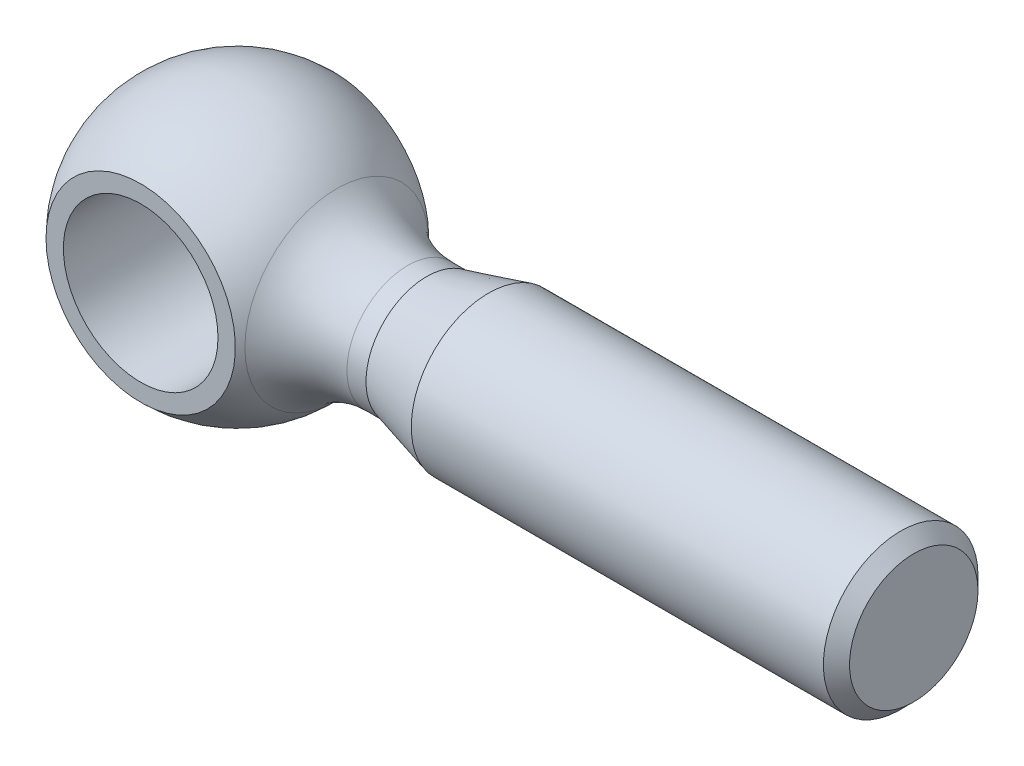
from build123d import *

# Parameters (mm, degrees)
SKETCH2_R               = 4
BASEBODY_DEPTH          = 35
CUT_EXTRUDE1_DEPTH      = 37.373066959
CUT_EXTRUDE1_DEPTH_BACK = 37.373066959
SKETCH4_R               = 4
HOLE_DEPTH              = 38.067505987
CHAMFER1_SIZE           = 0.6765
HEADFILLET_R            = 5


with BuildPart() as part:
    # Sketch2 → BaseBody (new body)
    with BuildSketch(Plane(origin=(0, 0, 0), x_dir=(0, 0, -1), z_dir=(1, 0, 0))):
        Circle(SKETCH2_R)
    extrude(amount=BASEBODY_DEPTH)

    # Sketch5 → Cut-Revolve1 (revolve, cut)
    with BuildSketch(Plane.XY, mode=Mode.PRIVATE) as cut_revolve1_sk:
        Polygon((0, 3.142562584), (9.8, 3.142562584), (13, 4), (0, 4), align=None)
    revolve(cut_revolve1_sk.sketch.rotate(Axis((35, 0, 0), (-1, 0, 0)), 90), axis=Axis((35, 0, 0), (-1, 0, 0)), mode=Mode.SUBTRACT)

    # Sketch1 → BaseHead (revolve)
    with BuildSketch(Plane(origin=(0.956717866, 0, -6.043282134), x_dir=(0, 0, -1), z_dir=(0, 1, 0))):
        with BuildLine():
            Line((-13.043282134, 0.956717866), (0.956717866, 0.956717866))
            ThreePointArc((0.956717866, 0.956717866), (-6.043282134, 7.956717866), (-13.043282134, 0.956717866))
        make_face()
    revolve(axis=Axis((0, 0, 13.34823651), (0, 0, -1)))

    # Sketch3 → Cut-Extrude1 (cut, two sides: drawn at the far end of the back side and taken through both)
    with BuildSketch(Plane(origin=(0, 0, 0), x_dir=(0, 0, -1), z_dir=(1, 0, 0)).offset(-CUT_EXTRUDE1_DEPTH_BACK)):
        with BuildLine():
            Line((-5, 4.898979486), (-5, -4.898979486))
            ThreePointArc((-5, -4.898979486), (-7, 0), (-5, 4.898979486))
        make_face()
        with BuildLine():
            Line((5, 4.898979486), (5, -4.898979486))
            ThreePointArc((5, -4.898979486), (7, 0), (5, 4.898979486))
        make_face()
    extrude(amount=CUT_EXTRUDE1_DEPTH + CUT_EXTRUDE1_DEPTH_BACK, mode=Mode.SUBTRACT)

    # Sketch4 → Hole (cut, through all)
    with BuildSketch(Plane.XY.offset(5)):
        Circle(SKETCH4_R)
    extrude(amount=-HOLE_DEPTH, mode=Mode.SUBTRACT)

    # Chamfer1
    chamfer1_edges = [part.edges().sort_by_distance(p)[0] for p in [
        (35, 0, 4),
    ]]
    chamfer(chamfer1_edges, length=CHAMFER1_SIZE)

    # HeadFillet
    headfillet_edges = [part.edges().sort_by_distance(p)[0] for p in [
        (6.254942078, 0, 3.142562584),
    ]]
    fillet(headfillet_edges, radius=HEADFILLET_R)


solid = part.part
